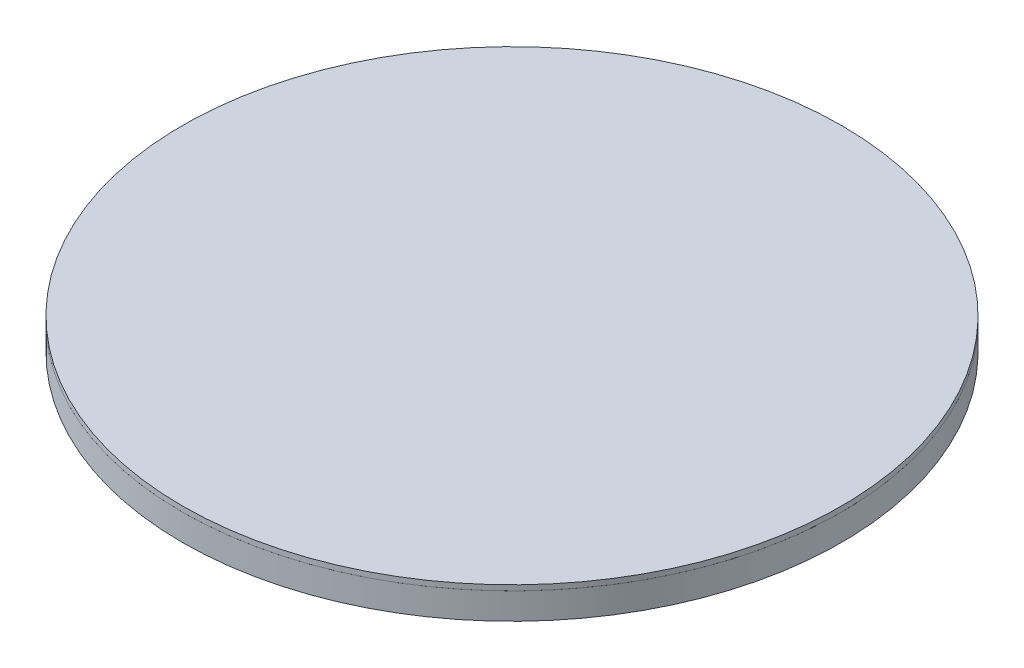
ISO-10303-21;
HEADER;
FILE_DESCRIPTION(('STEP AP214'),'2;1');
FILE_NAME('part.step','',(''),(''),'','','');
FILE_SCHEMA(('AUTOMOTIVE_DESIGN { 1 0 10303 214 1 1 1 1 }'));
ENDSEC;
DATA;
#1=APPLICATION_CONTEXT('core data for automotive mechanical design processes');
#2=APPLICATION_PROTOCOL_DEFINITION('international standard','automotive_design',2000,#1);
#3=PRODUCT_CONTEXT('',#1,'mechanical');
#4=PRODUCT('Part','Part','',(#3));
#5=PRODUCT_RELATED_PRODUCT_CATEGORY('part','',(#4));
#6=PRODUCT_DEFINITION_FORMATION('','',#4);
#7=PRODUCT_DEFINITION_CONTEXT('part definition',#1,'design');
#8=PRODUCT_DEFINITION('design','',#6,#7);
#9=PRODUCT_DEFINITION_SHAPE('','',#8);
#10=(LENGTH_UNIT() NAMED_UNIT(*) SI_UNIT(.MILLI.,.METRE.));
#11=(NAMED_UNIT(*) PLANE_ANGLE_UNIT() SI_UNIT($,.RADIAN.));
#12=(NAMED_UNIT(*) SI_UNIT($,.STERADIAN.) SOLID_ANGLE_UNIT());
#13=UNCERTAINTY_MEASURE_WITH_UNIT(LENGTH_MEASURE(1.E-05),#10,'distance_accuracy_value','');
#14=(GEOMETRIC_REPRESENTATION_CONTEXT(3) GLOBAL_UNCERTAINTY_ASSIGNED_CONTEXT((#13)) GLOBAL_UNIT_ASSIGNED_CONTEXT((#10,
#11,#12)) REPRESENTATION_CONTEXT('',''));
#15=CARTESIAN_POINT('',(0.,0.,0.));
#16=DIRECTION('',(0.,0.,1.));
#17=DIRECTION('',(1.,0.,0.));
#18=AXIS2_PLACEMENT_3D('',#15,#16,#17);
#19=CARTESIAN_POINT('',(0.,1.2,0.));
#20=DIRECTION('',(0.,-1.,0.));
#21=DIRECTION('',(0.,0.,-1.));
#22=AXIS2_PLACEMENT_3D('',#19,#20,#21);
#23=CYLINDRICAL_SURFACE('',#22,12.5);
#24=CARTESIAN_POINT('',(0.,0.,0.));
#25=DIRECTION('',(0.,1.,0.));
#26=DIRECTION('',(0.,0.,1.));
#27=AXIS2_PLACEMENT_3D('',#24,#25,#26);
#28=CIRCLE('',#27,12.5);
#29=CARTESIAN_POINT('',(0.,0.,12.5));
#30=VERTEX_POINT('',#29);
#31=EDGE_CURVE('E53',#30,#30,#28,.T.);
#32=ORIENTED_EDGE('',*,*,#31,.T.);
#33=EDGE_LOOP('',(#32));
#34=FACE_BOUND('',#33,.T.);
#35=CARTESIAN_POINT('',(0.,0.999,0.));
#36=DIRECTION('',(0.,1.,0.));
#37=DIRECTION('',(0.,0.,1.));
#38=AXIS2_PLACEMENT_3D('',#35,#36,#37);
#39=CIRCLE('',#38,12.5);
#40=CARTESIAN_POINT('',(0.,0.999,12.5));
#41=VERTEX_POINT('',#40);
#42=EDGE_CURVE('E62',#41,#41,#39,.T.);
#43=ORIENTED_EDGE('',*,*,#42,.F.);
#44=EDGE_LOOP('',(#43));
#45=FACE_BOUND('',#44,.T.);
#46=ADVANCED_FACE('F49',(#34,#45),#23,.T.);
#47=CARTESIAN_POINT('',(0.,0.,0.));
#48=DIRECTION('',(0.,1.,0.));
#49=DIRECTION('',(0.,0.,1.));
#50=AXIS2_PLACEMENT_3D('',#47,#48,#49);
#51=PLANE('',#50);
#52=ORIENTED_EDGE('',*,*,#31,.F.);
#53=EDGE_LOOP('',(#52));
#54=FACE_BOUND('',#53,.T.);
#55=ADVANCED_FACE('F87',(#54),#51,.F.);
#56=CARTESIAN_POINT('',(0.,0.999,0.));
#57=DIRECTION('',(0.,1.,0.));
#58=DIRECTION('',(0.,0.,1.));
#59=AXIS2_PLACEMENT_3D('',#56,#57,#58);
#60=PLANE('',#59);
#61=CARTESIAN_POINT('',(0.,0.999,0.));
#62=DIRECTION('',(0.,1.,0.));
#63=DIRECTION('',(0.,0.,1.));
#64=AXIS2_PLACEMENT_3D('',#61,#62,#63);
#65=CIRCLE('',#64,12.);
#66=CARTESIAN_POINT('',(0.,0.999,12.));
#67=VERTEX_POINT('',#66);
#68=EDGE_CURVE('E68',#67,#67,#65,.T.);
#69=ORIENTED_EDGE('',*,*,#68,.F.);
#70=EDGE_LOOP('',(#69));
#71=FACE_BOUND('',#70,.T.);
#72=ORIENTED_EDGE('',*,*,#42,.T.);
#73=EDGE_LOOP('',(#72));
#74=FACE_BOUND('',#73,.T.);
#75=ADVANCED_FACE('F83',(#71,#74),#60,.T.);
#76=CARTESIAN_POINT('',(0.,1.,0.));
#77=DIRECTION('',(0.,1.,0.));
#78=DIRECTION('',(0.,0.,1.));
#79=AXIS2_PLACEMENT_3D('',#76,#77,#78);
#80=PLANE('',#79);
#81=CARTESIAN_POINT('',(0.,1.,0.));
#82=DIRECTION('',(0.,1.,0.));
#83=DIRECTION('',(0.,0.,1.));
#84=AXIS2_PLACEMENT_3D('',#81,#82,#83);
#85=CIRCLE('',#84,12.);
#86=CARTESIAN_POINT('',(0.,1.,12.));
#87=VERTEX_POINT('',#86);
#88=EDGE_CURVE('E72',#87,#87,#85,.T.);
#89=ORIENTED_EDGE('',*,*,#88,.T.);
#90=EDGE_LOOP('',(#89));
#91=FACE_BOUND('',#90,.T.);
#92=CARTESIAN_POINT('',(0.,1.,0.));
#93=DIRECTION('',(0.,1.,0.));
#94=DIRECTION('',(0.,0.,1.));
#95=AXIS2_PLACEMENT_3D('',#92,#93,#94);
#96=CIRCLE('',#95,12.5);
#97=CARTESIAN_POINT('',(0.,1.,12.5));
#98=VERTEX_POINT('',#97);
#99=EDGE_CURVE('E64',#98,#98,#96,.T.);
#100=ORIENTED_EDGE('',*,*,#99,.F.);
#101=EDGE_LOOP('',(#100));
#102=FACE_BOUND('',#101,.T.);
#103=ADVANCED_FACE('F86',(#91,#102),#80,.F.);
#104=CARTESIAN_POINT('',(0.,0.999,0.));
#105=DIRECTION('',(0.,1.,0.));
#106=DIRECTION('',(0.,0.,1.));
#107=AXIS2_PLACEMENT_3D('',#104,#105,#106);
#108=CYLINDRICAL_SURFACE('',#107,12.);
#109=ORIENTED_EDGE('',*,*,#68,.T.);
#110=EDGE_LOOP('',(#109));
#111=FACE_BOUND('',#110,.T.);
#112=ORIENTED_EDGE('',*,*,#88,.F.);
#113=EDGE_LOOP('',(#112));
#114=FACE_BOUND('',#113,.T.);
#115=ADVANCED_FACE('F80',(#111,#114),#108,.T.);
#116=CARTESIAN_POINT('',(0.,1.2,0.));
#117=DIRECTION('',(0.,1.,0.));
#118=DIRECTION('',(0.,0.,1.));
#119=AXIS2_PLACEMENT_3D('',#116,#117,#118);
#120=PLANE('',#119);
#121=CARTESIAN_POINT('',(0.,1.2,0.));
#122=DIRECTION('',(0.,1.,0.));
#123=DIRECTION('',(0.,0.,1.));
#124=AXIS2_PLACEMENT_3D('',#121,#122,#123);
#125=CIRCLE('',#124,12.5);
#126=CARTESIAN_POINT('',(0.,1.2,12.5));
#127=VERTEX_POINT('',#126);
#128=EDGE_CURVE('E10',#127,#127,#125,.T.);
#129=ORIENTED_EDGE('',*,*,#128,.T.);
#130=EDGE_LOOP('',(#129));
#131=FACE_BOUND('',#130,.T.);
#132=ADVANCED_FACE('F98',(#131),#120,.T.);
#133=ORIENTED_EDGE('',*,*,#99,.T.);
#134=EDGE_LOOP('',(#133));
#135=FACE_BOUND('',#134,.T.);
#136=ORIENTED_EDGE('',*,*,#128,.F.);
#137=EDGE_LOOP('',(#136));
#138=FACE_BOUND('',#137,.T.);
#139=ADVANCED_FACE('F51',(#135,#138),#23,.T.);
#140=CLOSED_SHELL('',(#46,#55,#75,#103,#115,#132,#139));
#141=MANIFOLD_SOLID_BREP('B2',#140);
#142=ADVANCED_BREP_SHAPE_REPRESENTATION('',(#18,#141),#14);
#143=SHAPE_DEFINITION_REPRESENTATION(#9,#142);
ENDSEC;
END-ISO-10303-21;
